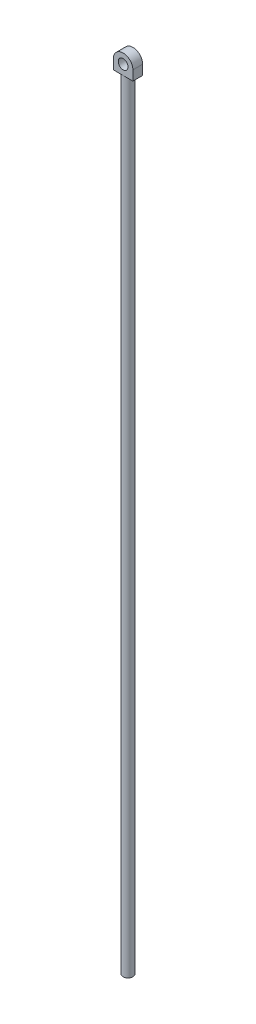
from build123d import *

# Parameters (mm, degrees)
SKETCH1_R           = 5
BOSS_EXTRUDE1_DEPTH = 5
SKETCH2_R           = 5
BOSS_EXTRUDE3_DEPTH = 800


with BuildPart() as part:
    # Sketch1 → Boss-Extrude1 (new, symmetric)
    with BuildSketch(Plane.XY):
        with BuildLine():
            Line((-10, 0), (-10, -10))
            Line((-10, -10), (10, -10))
            Line((10, -10), (10, 0))
            ThreePointArc((10, 0), (0, 10), (-10, 0))
        make_face()
        Circle(SKETCH1_R, mode=Mode.SUBTRACT)
    extrude(amount=BOSS_EXTRUDE1_DEPTH, both=True)

    # Sketch2 → Boss-Extrude3 (add)
    with BuildSketch(Plane.XZ.offset(10)):
        with Locations(Location((0, 0, 0), (0, 0, 270))):
            Circle(SKETCH2_R)
    extrude(amount=BOSS_EXTRUDE3_DEPTH)


solid = part.part
